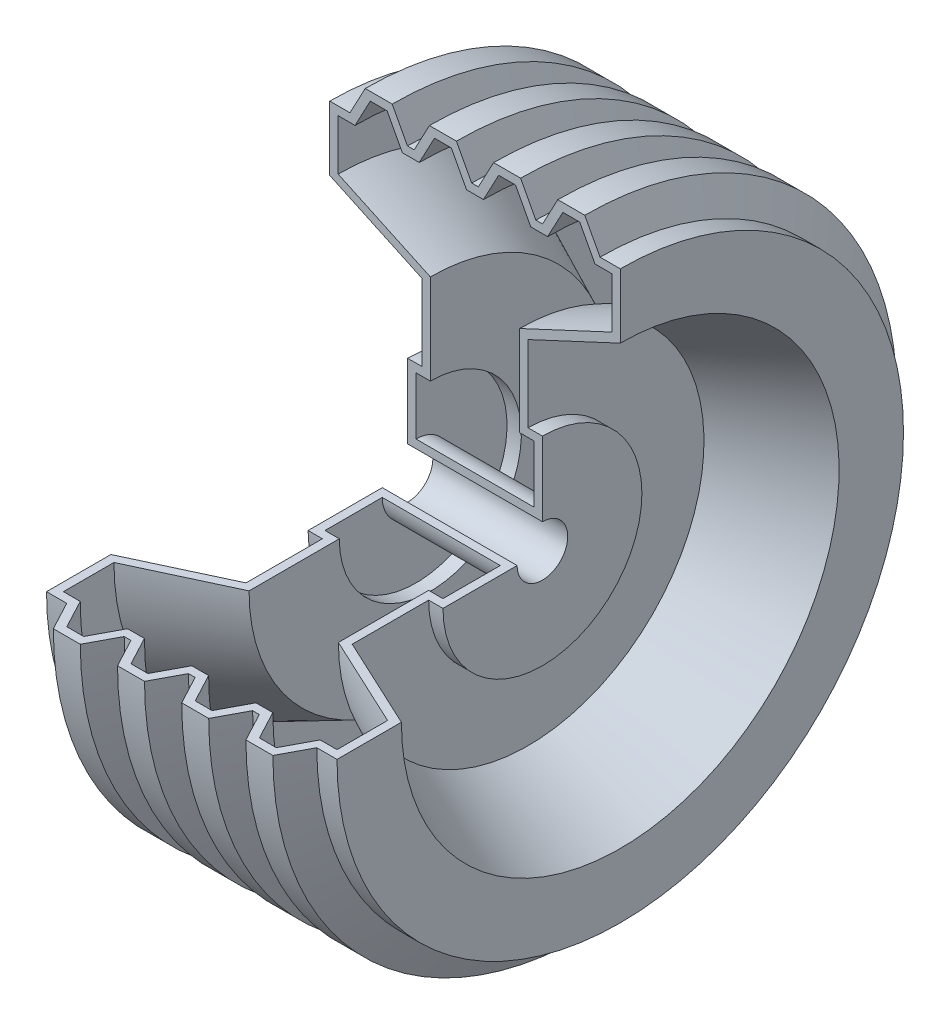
from build123d import *

# Parameters (mm, degrees)
REVOLVE_THIN1_ANGLE = 270


with BuildPart() as part:
    # Sketch1 → Revolve-Thin1 (revolve)
    with BuildSketch(Plane.XY):
        Polygon((-1.995696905, 168), (-11.034757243, 185), (-27.043363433, 185), (-36.082423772, 168), (-40.073817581, 168), (-49.11287792, 185), (-65.12148411, 185), (-74.160544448, 168), (-86.156241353, 168), (-86.156241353, 129.814648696), (-31.5, 104.328024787), (-31.5, 59), (-40, 59), (-40, 15), (40, 15), (40, 59), (31.5, 59), (31.5, 104.328024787), (86.156241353, 129.814648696), (86.156241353, 168), (74.160544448, 168), (65.12148411, 185), (49.11287792, 185), (40.073817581, 168), (36.082423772, 168), (27.043363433, 185), (11.034757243, 185), (1.995696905, 168), align=None)
        Polygon((-5, 163), (-14.039060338, 180), (-24.039060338, 180), (-33.078120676, 163), (-43.078120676, 163), (-52.117181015, 180), (-62.117181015, 180), (-71.156241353, 163), (-81.156241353, 163), (-81.156241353, 133), (-26.5, 107.513376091), (-26.5, 54), (-35, 54), (-35, 20), (35, 20), (35, 54), (26.5, 54), (26.5, 107.513376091), (81.156241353, 133), (81.156241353, 163), (71.156241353, 163), (62.117181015, 180), (52.117181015, 180), (43.078120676, 163), (33.078120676, 163), (24.039060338, 180), (14.039060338, 180), (5, 163), align=None, mode=Mode.SUBTRACT)
    revolve(axis=Axis((-56.654652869, 0, 0), (-1, 0, 0)), revolution_arc=REVOLVE_THIN1_ANGLE)


solid = part.part
